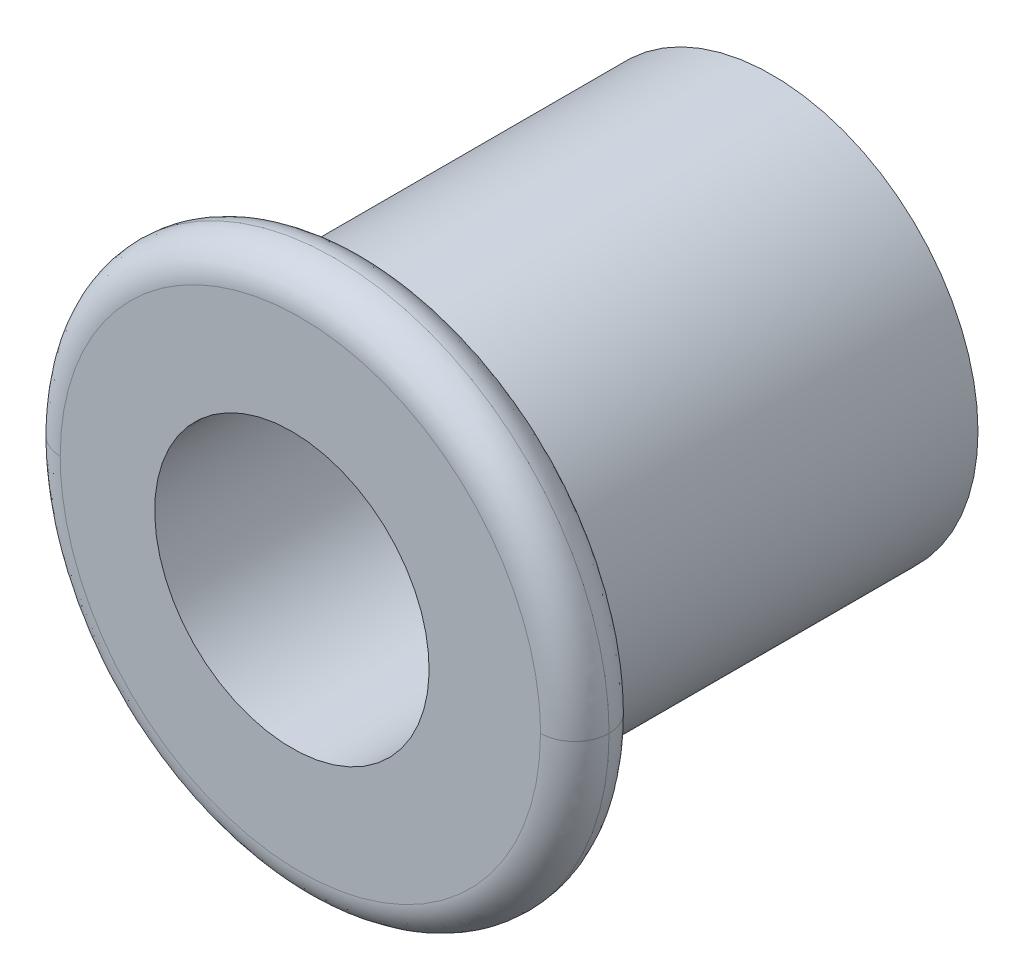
ISO-10303-21;
HEADER;
FILE_DESCRIPTION(('STEP AP214'),'2;1');
FILE_NAME('part.step','',(''),(''),'','','');
FILE_SCHEMA(('AUTOMOTIVE_DESIGN { 1 0 10303 214 1 1 1 1 }'));
ENDSEC;
DATA;
#1=APPLICATION_CONTEXT('core data for automotive mechanical design processes');
#2=APPLICATION_PROTOCOL_DEFINITION('international standard','automotive_design',2000,#1);
#3=PRODUCT_CONTEXT('',#1,'mechanical');
#4=PRODUCT('Part','Part','',(#3));
#5=PRODUCT_RELATED_PRODUCT_CATEGORY('part','',(#4));
#6=PRODUCT_DEFINITION_FORMATION('','',#4);
#7=PRODUCT_DEFINITION_CONTEXT('part definition',#1,'design');
#8=PRODUCT_DEFINITION('design','',#6,#7);
#9=PRODUCT_DEFINITION_SHAPE('','',#8);
#10=(LENGTH_UNIT() NAMED_UNIT(*) SI_UNIT(.MILLI.,.METRE.));
#11=(NAMED_UNIT(*) PLANE_ANGLE_UNIT() SI_UNIT($,.RADIAN.));
#12=(NAMED_UNIT(*) SI_UNIT($,.STERADIAN.) SOLID_ANGLE_UNIT());
#13=UNCERTAINTY_MEASURE_WITH_UNIT(LENGTH_MEASURE(1.E-05),#10,'distance_accuracy_value','');
#14=(GEOMETRIC_REPRESENTATION_CONTEXT(3) GLOBAL_UNCERTAINTY_ASSIGNED_CONTEXT((#13)) GLOBAL_UNIT_ASSIGNED_CONTEXT((#10,
#11,#12)) REPRESENTATION_CONTEXT('',''));
#15=CARTESIAN_POINT('',(0.,0.,0.));
#16=DIRECTION('',(0.,0.,1.));
#17=DIRECTION('',(1.,0.,0.));
#18=AXIS2_PLACEMENT_3D('',#15,#16,#17);
#19=CARTESIAN_POINT('',(0.,0.,1.905));
#20=DIRECTION('',(0.,0.,-1.));
#21=DIRECTION('',(-1.,0.,0.));
#22=AXIS2_PLACEMENT_3D('',#19,#20,#21);
#23=CYLINDRICAL_SURFACE('',#22,0.9525);
#24=CARTESIAN_POINT('',(0.,0.,1.905));
#25=DIRECTION('',(0.,0.,-1.));
#26=DIRECTION('',(-1.,0.,0.));
#27=AXIS2_PLACEMENT_3D('',#24,#25,#26);
#28=CIRCLE('',#27,0.9525);
#29=CARTESIAN_POINT('',(-0.9525,0.,1.905));
#30=VERTEX_POINT('',#29);
#31=EDGE_CURVE('E69',#30,#30,#28,.T.);
#32=ORIENTED_EDGE('',*,*,#31,.T.);
#33=EDGE_LOOP('',(#32));
#34=FACE_BOUND('',#33,.T.);
#35=CARTESIAN_POINT('',(0.,0.,0.));
#36=DIRECTION('',(0.,0.,-1.));
#37=DIRECTION('',(-1.,0.,0.));
#38=AXIS2_PLACEMENT_3D('',#35,#36,#37);
#39=CIRCLE('',#38,0.9525);
#40=CARTESIAN_POINT('',(-0.9525,0.,0.));
#41=VERTEX_POINT('',#40);
#42=EDGE_CURVE('E20',#41,#41,#39,.F.);
#43=ORIENTED_EDGE('',*,*,#42,.T.);
#44=EDGE_LOOP('',(#43));
#45=FACE_BOUND('',#44,.T.);
#46=ADVANCED_FACE('F15',(#34,#45),#23,.T.);
#47=CARTESIAN_POINT('',(-1.2301340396,0.,2.0795985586));
#48=CARTESIAN_POINT('',(-1.2301340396,-2.5384138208,2.0795985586));
#49=CARTESIAN_POINT('',(1.3082798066,-2.5384138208,2.0795985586));
#50=CARTESIAN_POINT('',(1.3082798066,0.,2.0795985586));
#51=CARTESIAN_POINT('',(-1.240963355,0.,1.9716664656));
#52=CARTESIAN_POINT('',(-1.240963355,-2.560072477,1.9716664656));
#53=CARTESIAN_POINT('',(1.319109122,-2.560072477,1.9716664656));
#54=CARTESIAN_POINT('',(1.319109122,0.,1.9716664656));
#55=CARTESIAN_POINT('',(-1.1642606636,0.,1.8949637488));
#56=CARTESIAN_POINT('',(-1.1642606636,-2.4066670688,1.8949637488));
#57=CARTESIAN_POINT('',(1.2424064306,-2.4066670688,1.8949637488));
#58=CARTESIAN_POINT('',(1.2424064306,0.,1.8949637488));
#59=CARTESIAN_POINT('',(-1.0563285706,0.,1.9057930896));
#60=CARTESIAN_POINT('',(-1.0563285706,-2.1908028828,1.9057930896));
#61=CARTESIAN_POINT('',(1.1344743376,-2.1908028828,1.9057930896));
#62=CARTESIAN_POINT('',(1.1344743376,0.,1.9057930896));
#63=(BOUNDED_SURFACE() B_SPLINE_SURFACE(3,3,((#47,#48,#49,#50),(#51,#52,#53,#54),(#55,#56,#57,
#58),(#59,#60,#61,#62)),.UNSPECIFIED.,.F.,.F.,.F.) B_SPLINE_SURFACE_WITH_KNOTS((4,4),(4,4),(0.,
1.),(0.,1.),.UNSPECIFIED.) GEOMETRIC_REPRESENTATION_ITEM() RATIONAL_B_SPLINE_SURFACE(((1.,
0.333333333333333,0.333333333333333,1.),(0.755320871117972,0.251773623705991,0.251773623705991,
0.755320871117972),(0.755320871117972,0.251773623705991,0.251773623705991,0.755320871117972),
(1.,0.333333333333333,0.333333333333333,1.))) REPRESENTATION_ITEM('') SURFACE());
#64=CARTESIAN_POINT('',(1.3082798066,0.,2.0795985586));
#65=CARTESIAN_POINT('',(1.319109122,0.,1.9716664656));
#66=CARTESIAN_POINT('',(1.2424064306,0.,1.8949637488));
#67=CARTESIAN_POINT('',(1.1344743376,0.,1.9057930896));
#68=(BOUNDED_CURVE() B_SPLINE_CURVE(3,(#64,#65,#66,#67),.UNSPECIFIED.,.F.,
.F.) B_SPLINE_CURVE_WITH_KNOTS((4,4),(0.,1.),
.UNSPECIFIED.) CURVE() GEOMETRIC_REPRESENTATION_ITEM() RATIONAL_B_SPLINE_CURVE((1.,
0.755320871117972,0.755320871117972,1.)) REPRESENTATION_ITEM(''));
#69=CARTESIAN_POINT('',(1.15032289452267,0.,1.90499999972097));
#70=VERTEX_POINT('',#69);
#71=CARTESIAN_POINT('',(1.30907289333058,0.,2.06374999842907));
#72=VERTEX_POINT('',#71);
#73=EDGE_CURVE('E62',#70,#72,#68,.F.);
#74=CARTESIAN_POINT('',(0.0390728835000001,0.,2.06374999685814));
#75=DIRECTION('',(0.,0.,1.));
#76=DIRECTION('',(0.,-1.,0.));
#77=AXIS2_PLACEMENT_3D('',#74,#75,#76);
#78=CIRCLE('',#77,1.27000000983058);
#79=CARTESIAN_POINT('',(-1.23092712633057,0.,2.06374999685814));
#80=VERTEX_POINT('',#79);
#81=EDGE_CURVE('E56',#80,#72,#78,.T.);
#82=CARTESIAN_POINT('',(-1.2301340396,0.,2.0795985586));
#83=CARTESIAN_POINT('',(-1.240963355,0.,1.9716664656));
#84=CARTESIAN_POINT('',(-1.1642606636,0.,1.8949637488));
#85=CARTESIAN_POINT('',(-1.0563285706,0.,1.9057930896));
#86=(BOUNDED_CURVE() B_SPLINE_CURVE(3,(#82,#83,#84,#85),.UNSPECIFIED.,.F.,
.F.) B_SPLINE_CURVE_WITH_KNOTS((4,4),(0.,1.),
.UNSPECIFIED.) CURVE() GEOMETRIC_REPRESENTATION_ITEM() RATIONAL_B_SPLINE_CURVE((1.,
0.755320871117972,0.755320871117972,1.)) REPRESENTATION_ITEM(''));
#87=CARTESIAN_POINT('',(-1.07217711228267,0.,1.90499999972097));
#88=VERTEX_POINT('',#87);
#89=EDGE_CURVE('E50',#80,#88,#86,.T.);
#90=CARTESIAN_POINT('',(-1.07217710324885,0.,1.90499999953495));
#91=CARTESIAN_POINT('',(-1.07217717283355,-0.0117582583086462,1.90499999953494));
#92=CARTESIAN_POINT('',(-1.07199048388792,-0.023516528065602,1.90499999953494));
#93=CARTESIAN_POINT('',(-1.07123223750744,-0.0473940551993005,1.90499999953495));
#94=CARTESIAN_POINT('',(-1.07064865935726,-0.0595129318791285,1.90499999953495));
#95=CARTESIAN_POINT('',(-1.06906020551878,-0.0841085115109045,1.90499999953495));
#96=CARTESIAN_POINT('',(-1.06804257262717,-0.0965843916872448,1.90499999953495));
#97=CARTESIAN_POINT('',(-1.06554765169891,-0.121888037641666,1.90499999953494));
#98=CARTESIAN_POINT('',(-1.06405686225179,-0.134714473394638,1.90499999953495));
#99=CARTESIAN_POINT('',(-1.06057530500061,-0.160710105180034,1.90499999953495));
#100=CARTESIAN_POINT('',(-1.05857028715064,-0.173877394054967,1.90499999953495));
#101=CARTESIAN_POINT('',(-1.05401816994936,-0.20054199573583,1.90499999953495));
#102=CARTESIAN_POINT('',(-1.0514560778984,-0.214036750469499,1.90499999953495));
#103=CARTESIAN_POINT('',(-1.04574613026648,-0.241339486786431,1.90499999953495));
#104=CARTESIAN_POINT('',(-1.04258255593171,-0.25514418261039,1.90499999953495));
#105=CARTESIAN_POINT('',(-1.03562466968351,-0.283045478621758,1.90499999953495));
#106=CARTESIAN_POINT('',(-1.03181394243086,-0.297137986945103,1.90499999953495));
#107=CARTESIAN_POINT('',(-1.02351584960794,-0.325588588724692,1.90499999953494));
#108=CARTESIAN_POINT('',(-1.01901141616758,-0.3399417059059,1.90499999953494));
#109=CARTESIAN_POINT('',(-1.00927954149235,-0.368881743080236,1.90499999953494));
#110=CARTESIAN_POINT('',(-1.00403444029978,-0.383462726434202,1.90499999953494));
#111=CARTESIAN_POINT('',(-0.992774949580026,-0.412820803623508,1.90499999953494));
#112=CARTESIAN_POINT('',(-0.986742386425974,-0.427590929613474,1.90499999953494));
#113=CARTESIAN_POINT('',(-0.973862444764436,-0.457283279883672,1.90499999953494));
#114=CARTESIAN_POINT('',(-0.966996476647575,-0.472197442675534,1.90499999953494));
#115=CARTESIAN_POINT('',(-0.952405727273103,-0.502127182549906,1.90499999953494));
#116=CARTESIAN_POINT('',(-0.944662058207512,-0.517133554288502,1.90499999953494));
#117=CARTESIAN_POINT('',(-0.92827432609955,-0.547190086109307,1.90499999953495));
#118=CARTESIAN_POINT('',(-0.919611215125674,-0.562229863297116,1.90499999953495));
#119=CARTESIAN_POINT('',(-0.901346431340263,-0.592288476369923,1.90499999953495));
#120=CARTESIAN_POINT('',(-0.891725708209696,-0.607295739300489,1.90499999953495));
#121=CARTESIAN_POINT('',(-0.871512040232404,-0.637217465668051,1.90499999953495));
#122=CARTESIAN_POINT('',(-0.860900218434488,-0.652119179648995,1.90499999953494));
#123=CARTESIAN_POINT('',(-0.838676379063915,-0.681750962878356,1.90499999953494));
#124=CARTESIAN_POINT('',(-0.827045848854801,-0.696467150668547,1.90499999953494));
#125=CARTESIAN_POINT('',(-0.802763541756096,-0.725642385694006,1.90499999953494));
#126=CARTESIAN_POINT('',(-0.790093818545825,-0.740086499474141,1.90499999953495));
#127=CARTESIAN_POINT('',(-0.763720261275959,-0.768625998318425,1.90499999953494));
#128=CARTESIAN_POINT('',(-0.749999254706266,-0.782705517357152,1.90499999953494));
#129=CARTESIAN_POINT('',(-0.721519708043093,-0.810418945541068,1.90499999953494));
#130=CARTESIAN_POINT('',(-0.706744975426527,-0.824036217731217,1.90499999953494));
#131=CARTESIAN_POINT('',(-0.676165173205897,-0.8507240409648,1.90499999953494));
#132=CARTESIAN_POINT('',(-0.660345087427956,-0.863777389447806,1.90499999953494));
#133=CARTESIAN_POINT('',(-0.627693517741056,-0.889233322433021,1.90499999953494));
#134=CARTESIAN_POINT('',(-0.610848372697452,-0.901618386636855,1.90499999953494));
#135=CARTESIAN_POINT('',(-0.576178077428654,-0.925632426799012,1.90499999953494));
#136=CARTESIAN_POINT('',(-0.558340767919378,-0.937243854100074,1.90499999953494));
#137=CARTESIAN_POINT('',(-0.521731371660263,-0.959605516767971,1.90499999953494));
#138=CARTESIAN_POINT('',(-0.502948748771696,-0.970338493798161,1.90499999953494));
#139=CARTESIAN_POINT('',(-0.464505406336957,-0.990841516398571,1.90499999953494));
#140=CARTESIAN_POINT('',(-0.44483580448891,-1.00059495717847,1.90499999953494));
#141=CARTESIAN_POINT('',(-0.414826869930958,-1.01438377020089,1.90499999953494));
#142=CARTESIAN_POINT('',(-0.404687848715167,-1.01886004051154,1.90499999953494));
#143=CARTESIAN_POINT('',(-0.384217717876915,-1.02753388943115,1.90499999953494));
#144=CARTESIAN_POINT('',(-0.373885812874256,-1.03172959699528,1.90499999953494));
#145=CARTESIAN_POINT('',(-0.353041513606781,-1.03983103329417,1.90499999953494));
#146=CARTESIAN_POINT('',(-0.3425284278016,-1.04373498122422,1.90499999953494));
#147=CARTESIAN_POINT('',(-0.321333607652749,-1.0512424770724,1.90499999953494));
#148=CARTESIAN_POINT('',(-0.3106512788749,-1.05484434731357,1.90499999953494));
#149=CARTESIAN_POINT('',(-0.289130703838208,-1.06173782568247,1.90499999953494));
#150=CARTESIAN_POINT('',(-0.278291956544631,-1.06502786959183,1.90499999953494));
#151=CARTESIAN_POINT('',(-0.256471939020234,-1.0712885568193,1.90499999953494));
#152=CARTESIAN_POINT('',(-0.2454902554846,-1.07425775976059,1.90499999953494));
#153=CARTESIAN_POINT('',(-0.223398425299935,-1.07986838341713,1.90499999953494));
#154=CARTESIAN_POINT('',(-0.212287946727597,-1.08250849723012,1.90499999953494));
#155=CARTESIAN_POINT('',(-0.189953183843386,-1.08745338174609,1.90499999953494));
#156=CARTESIAN_POINT('',(-0.178728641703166,-1.08975698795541,1.90499999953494));
#157=CARTESIAN_POINT('',(-0.156180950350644,-1.09402216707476,1.90499999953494));
#158=CARTESIAN_POINT('',(-0.144857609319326,-1.09598272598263,1.90499999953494));
#159=CARTESIAN_POINT('',(-0.122127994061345,-1.09955603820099,1.90499999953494));
#160=CARTESIAN_POINT('',(-0.110721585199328,-1.10116793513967,1.90499999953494));
#161=CARTESIAN_POINT('',(-0.0878419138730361,-1.10403910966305,1.90499999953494));
#162=CARTESIAN_POINT('',(-0.0763685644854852,-1.1052976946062,1.90499999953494));
#163=CARTESIAN_POINT('',(-0.0533714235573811,-1.10745842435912,1.90499999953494));
#164=CARTESIAN_POINT('',(-0.041847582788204,-1.10836004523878,1.90499999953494));
#165=CARTESIAN_POINT('',(-0.018766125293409,-1.10980404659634,1.90499999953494));
#166=CARTESIAN_POINT('',(-0.00720848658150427,-1.11034607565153,1.90499999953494));
#167=CARTESIAN_POINT('',(0.0159237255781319,-1.11106913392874,1.90499999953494));
#168=CARTESIAN_POINT('',(0.0274983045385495,-1.11124998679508,1.90499999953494));
#169=CARTESIAN_POINT('',(0.0506474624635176,-1.11124998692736,1.90499999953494));
#170=CARTESIAN_POINT('',(0.062222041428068,-1.11106913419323,1.90499999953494));
#171=CARTESIAN_POINT('',(0.0853542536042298,-1.1103460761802,1.90499999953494));
#172=CARTESIAN_POINT('',(0.0969118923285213,-1.10980404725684,1.90499999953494));
#173=CARTESIAN_POINT('',(0.119993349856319,-1.1083600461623,1.90499999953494));
#174=CARTESIAN_POINT('',(0.131517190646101,-1.10745842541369,1.90499999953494));
#175=CARTESIAN_POINT('',(0.154514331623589,-1.10529769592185,1.90499999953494));
#176=CARTESIAN_POINT('',(0.165987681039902,-1.10403911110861,1.90499999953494));
#177=CARTESIAN_POINT('',(0.188867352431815,-1.10116793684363,1.90499999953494));
#178=CARTESIAN_POINT('',(0.200273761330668,-1.09955604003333,1.90499999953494));
#179=CARTESIAN_POINT('',(0.223003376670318,-1.09598272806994,1.90499999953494));
#180=CARTESIAN_POINT('',(0.23432671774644,-1.09402216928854,1.90499999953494));
#181=CARTESIAN_POINT('',(0.256874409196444,-1.08975699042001,1.90499999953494));
#182=CARTESIAN_POINT('',(0.268098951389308,-1.08745338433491,1.90499999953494));
#183=CARTESIAN_POINT('',(0.290433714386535,-1.08250850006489,1.90499999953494));
#184=CARTESIAN_POINT('',(0.301544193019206,-1.07986838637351,1.90499999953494));
#185=CARTESIAN_POINT('',(0.323636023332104,-1.07425776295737,1.90499999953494));
#186=CARTESIAN_POINT('',(0.334617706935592,-1.07128856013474,1.90499999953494));
#187=CARTESIAN_POINT('',(0.35643772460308,-1.06502787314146,1.90499999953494));
#188=CARTESIAN_POINT('',(0.367276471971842,-1.0617378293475,1.90499999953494));
#189=CARTESIAN_POINT('',(0.388797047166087,-1.05484435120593,1.90499999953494));
#190=CARTESIAN_POINT('',(0.399479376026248,-1.05124248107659,1.90499999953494));
#191=CARTESIAN_POINT('',(0.420674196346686,-1.0437349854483,1.90499999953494));
#192=CARTESIAN_POINT('',(0.431187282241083,-1.03983103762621,1.90499999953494));
#193=CARTESIAN_POINT('',(0.452031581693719,-1.03172960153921,1.90499999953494));
#194=CARTESIAN_POINT('',(0.46236348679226,-1.02753389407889,1.90499999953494));
#195=CARTESIAN_POINT('',(0.482833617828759,-1.01886004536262,1.90499999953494));
#196=CARTESIAN_POINT('',(0.492972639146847,-1.01438377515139,1.90499999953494));
#197=CARTESIAN_POINT('',(0.522981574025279,-1.00059496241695,1.90499999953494));
#198=CARTESIAN_POINT('',(0.542651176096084,-0.990841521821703,1.90499999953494));
#199=CARTESIAN_POINT('',(0.581094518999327,-0.970338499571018,1.90499999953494));
#200=CARTESIAN_POINT('',(0.59987714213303,-0.959605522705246,1.90499999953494));
#201=CARTESIAN_POINT('',(0.636486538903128,-0.937243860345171,1.90499999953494));
#202=CARTESIAN_POINT('',(0.654323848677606,-0.925632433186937,1.90499999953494));
#203=CARTESIAN_POINT('',(0.688994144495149,-0.901618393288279,1.90499999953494));
#204=CARTESIAN_POINT('',(0.705839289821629,-0.88923332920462,1.90499999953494));
#205=CARTESIAN_POINT('',(0.738490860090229,-0.863777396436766,1.90499999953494));
#206=CARTESIAN_POINT('',(0.754310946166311,-0.850724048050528,1.90499999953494));
#207=CARTESIAN_POINT('',(0.784890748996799,-0.824036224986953,1.90499999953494));
#208=CARTESIAN_POINT('',(0.799665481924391,-0.810418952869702,1.90499999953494));
#209=CARTESIAN_POINT('',(0.828145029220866,-0.782705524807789,1.90499999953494));
#210=CARTESIAN_POINT('',(0.841866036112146,-0.7686260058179,1.90499999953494));
#211=CARTESIAN_POINT('',(0.868239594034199,-0.740086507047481,1.90499999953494));
#212=CARTESIAN_POINT('',(0.88090931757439,-0.725642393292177,1.90499999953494));
#213=CARTESIAN_POINT('',(0.905191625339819,-0.696467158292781,1.90499999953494));
#214=CARTESIAN_POINT('',(0.91682215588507,-0.681750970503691,1.90499999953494));
#215=CARTESIAN_POINT('',(0.939045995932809,-0.652119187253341,1.90499999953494));
#216=CARTESIAN_POINT('',(0.949657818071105,-0.637217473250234,1.90499999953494));
#217=CARTESIAN_POINT('',(0.969871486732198,-0.607295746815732,1.90499999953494));
#218=CARTESIAN_POINT('',(0.979492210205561,-0.59228848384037,1.90499999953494));
#219=CARTESIAN_POINT('',(0.99775699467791,-0.562229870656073,1.90499999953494));
#220=CARTESIAN_POINT('',(1.00642010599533,-0.547190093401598,1.90499999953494));
#221=CARTESIAN_POINT('',(1.02280783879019,-0.517133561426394,1.90499999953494));
#222=CARTESIAN_POINT('',(1.03055150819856,-0.502127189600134,1.90499999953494));
#223=CARTESIAN_POINT('',(1.04514225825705,-0.472197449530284,1.90499999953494));
#224=CARTESIAN_POINT('',(1.05200822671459,-0.457283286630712,1.90499999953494));
#225=CARTESIAN_POINT('',(1.06488816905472,-0.427590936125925,1.90499999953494));
#226=CARTESIAN_POINT('',(1.07092073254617,-0.412820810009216,1.90499999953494));
#227=CARTESIAN_POINT('',(1.08218022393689,-0.383462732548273,1.90499999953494));
#228=CARTESIAN_POINT('',(1.08742532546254,-0.368881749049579,1.90499999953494));
#229=CARTESIAN_POINT('',(1.09715720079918,-0.339941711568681,1.90499999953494));
#230=CARTESIAN_POINT('',(1.10166163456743,-0.325588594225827,1.90499999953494));
#231=CARTESIAN_POINT('',(1.10995972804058,-0.297137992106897,1.90499999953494));
#232=CARTESIAN_POINT('',(1.11377045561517,-0.283045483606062,1.90499999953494));
#233=CARTESIAN_POINT('',(1.12072834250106,-0.25514418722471,1.90499999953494));
#234=CARTESIAN_POINT('',(1.12389191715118,-0.241339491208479,1.90499999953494));
#235=CARTESIAN_POINT('',(1.12960186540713,-0.214036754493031,1.90499999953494));
#236=CARTESIAN_POINT('',(1.13216395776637,-0.20054199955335,1.90499999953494));
#237=CARTESIAN_POINT('',(1.13671607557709,-0.173877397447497,1.90499999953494));
#238=CARTESIAN_POINT('',(1.13872109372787,-0.160710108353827,1.90499999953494));
#239=CARTESIAN_POINT('',(1.14220265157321,-0.134714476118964,1.90499999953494));
#240=CARTESIAN_POINT('',(1.14369344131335,-0.121888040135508,1.90499999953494));
#241=CARTESIAN_POINT('',(1.14618836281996,-0.096584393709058,1.90499999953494));
#242=CARTESIAN_POINT('',(1.14720599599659,-0.0841085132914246,1.90499999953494));
#243=CARTESIAN_POINT('',(1.14879445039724,-0.0595129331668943,1.90499999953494));
#244=CARTESIAN_POINT('',(1.14937802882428,-0.0473940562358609,1.90499999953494));
#245=CARTESIAN_POINT('',(1.15013627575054,-0.023516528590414,1.90499999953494));
#246=CARTESIAN_POINT('',(1.1503229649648,-0.0117582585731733,1.90499999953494));
#247=CARTESIAN_POINT('',(1.15032289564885,0.,1.90499999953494));
#248=B_SPLINE_CURVE_WITH_KNOTS('',3,(#90,#91,#92,#93,#94,#95,#96,#97,#98,#99,#100,#101,#102,
#103,#104,#105,#106,#107,#108,#109,#110,#111,#112,#113,#114,#115,#116,#117,#118,#119,#120,#121,
#122,#123,#124,#125,#126,#127,#128,#129,#130,#131,#132,#133,#134,#135,#136,#137,#138,#139,#140,
#141,#142,#143,#144,#145,#146,#147,#148,#149,#150,#151,#152,#153,#154,#155,#156,#157,#158,#159,
#160,#161,#162,#163,#164,#165,#166,#167,#168,#169,#170,#171,#172,#173,#174,#175,#176,#177,#178,
#179,#180,#181,#182,#183,#184,#185,#186,#187,#188,#189,#190,#191,#192,#193,#194,#195,#196,#197,
#198,#199,#200,#201,#202,#203,#204,#205,#206,#207,#208,#209,#210,#211,#212,#213,#214,#215,#216,
#217,#218,#219,#220,#221,#222,#223,#224,#225,#226,#227,#228,#229,#230,#231,#232,#233,#234,#235,
#236,#237,#238,#239,#240,#241,#242,#243,#244,#245,#246,#247),.UNSPECIFIED.,.F.,.F.,(4,2,2,2,2,2,
2,2,2,2,2,2,2,2,2,2,2,2,2,2,2,2,2,2,2,2,2,2,2,2,2,2,2,2,2,2,2,2,2,2,2,2,2,2,2,2,2,2,2,2,2,2,2,2,
2,2,2,2,2,2,2,2,2,2,2,2,2,2,2,2,2,2,2,2,2,2,2,2,4),(0.,0.0352733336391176,0.0716655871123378,
0.109210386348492,0.147940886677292,0.187889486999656,0.229087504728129,0.271564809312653,
0.315349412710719,0.36046701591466,0.406940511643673,0.454789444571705,0.50402943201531,
0.554671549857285,0.606721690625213,0.660179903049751,0.715039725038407,0.771287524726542,
0.828901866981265,0.887852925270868,0.948101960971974,1.00960089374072,1.07229198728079,
1.13610767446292,1.20097054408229,1.2667935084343,1.30003897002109,1.33348767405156,
1.36712620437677,1.40094064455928,1.43491660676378,1.46903926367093,1.5032933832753,
1.53766336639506,1.57213328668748,1.60668693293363,1.64130785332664,1.67597940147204,
1.71068478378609,1.74540710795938,1.78012943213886,1.8148348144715,1.84950636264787,
1.88412728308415,1.91868092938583,1.95315084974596,1.98752083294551,2.02177495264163,
2.05589760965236,2.08987357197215,2.12368801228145,2.15732654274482,2.19077524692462,
2.22402070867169,2.28984367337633,2.35470654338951,2.41852223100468,2.48121332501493,
2.54271225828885,2.60296129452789,2.66191235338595,2.71952669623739,2.77577449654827,
2.83063431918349,2.88409253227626,2.93614267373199,2.98678479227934,3.03602478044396,
3.08387371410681,3.13034721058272,3.17546481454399,3.21924941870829,3.2617267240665,
3.3029247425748,3.34287334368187,3.38160384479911,3.41914864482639,3.45554089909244,
3.4908142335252),.UNSPECIFIED.);
#249=EDGE_CURVE('E53',#88,#70,#248,.T.);
#250=ORIENTED_EDGE('',*,*,#73,.T.);
#251=ORIENTED_EDGE('',*,*,#81,.F.);
#252=ORIENTED_EDGE('',*,*,#89,.T.);
#253=ORIENTED_EDGE('',*,*,#249,.T.);
#254=EDGE_LOOP('',(#250,#251,#252,#253));
#255=FACE_BOUND('',#254,.T.);
#256=ADVANCED_FACE('F52',(#255),#63,.T.);
#257=CARTESIAN_POINT('',(-0.96393,-0.96393,0.));
#258=DIRECTION('',(0.,0.,1.));
#259=DIRECTION('',(1.,0.,0.));
#260=AXIS2_PLACEMENT_3D('',#257,#258,#259);
#261=PLANE('',#260);
#262=CARTESIAN_POINT('',(0.,0.,0.));
#263=DIRECTION('',(0.,0.,-1.));
#264=DIRECTION('',(0.,1.,0.));
#265=AXIS2_PLACEMENT_3D('',#262,#263,#264);
#266=CIRCLE('',#265,0.635);
#267=CARTESIAN_POINT('',(0.,0.634999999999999,0.));
#268=VERTEX_POINT('',#267);
#269=EDGE_CURVE('E75',#268,#268,#266,.T.);
#270=ORIENTED_EDGE('',*,*,#269,.F.);
#271=EDGE_LOOP('',(#270));
#272=FACE_BOUND('',#271,.T.);
#273=ORIENTED_EDGE('',*,*,#42,.F.);
#274=EDGE_LOOP('',(#273));
#275=FACE_BOUND('',#274,.T.);
#276=ADVANCED_FACE('F126',(#272,#275),#261,.F.);
#277=CARTESIAN_POINT('',(-1.0855121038,-1.124585,1.905));
#278=DIRECTION('',(0.,0.,1.));
#279=DIRECTION('',(1.,0.,0.));
#280=AXIS2_PLACEMENT_3D('',#277,#278,#279);
#281=PLANE('',#280);
#282=ORIENTED_EDGE('',*,*,#31,.F.);
#283=EDGE_LOOP('',(#282));
#284=FACE_BOUND('',#283,.T.);
#285=CARTESIAN_POINT('',(1.15032289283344,0.,1.90499999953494));
#286=CARTESIAN_POINT('',(1.15032289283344,2.22249999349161,1.90499999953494));
#287=CARTESIAN_POINT('',(-1.07217712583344,2.22249999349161,1.90499999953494));
#288=CARTESIAN_POINT('',(-1.07217712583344,0.,1.90499999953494));
#289=(BOUNDED_CURVE() B_SPLINE_CURVE(3,(#285,#286,#287,#288),.UNSPECIFIED.,.F.,
.F.) B_SPLINE_CURVE_WITH_KNOTS((4,4),(0.,1.),
.UNSPECIFIED.) CURVE() GEOMETRIC_REPRESENTATION_ITEM() RATIONAL_B_SPLINE_CURVE((0.956578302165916,
0.318859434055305,0.318859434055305,0.956578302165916)) REPRESENTATION_ITEM(''));
#290=EDGE_CURVE('E67',#70,#88,#289,.T.);
#291=ORIENTED_EDGE('',*,*,#290,.F.);
#292=ORIENTED_EDGE('',*,*,#249,.F.);
#293=EDGE_LOOP('',(#291,#292));
#294=FACE_BOUND('',#293,.T.);
#295=ADVANCED_FACE('F66',(#284,#294),#281,.F.);
#296=CARTESIAN_POINT('',(-1.0563285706,0.,2.2217069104));
#297=CARTESIAN_POINT('',(-1.0563285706,-2.1908028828,2.2217069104));
#298=CARTESIAN_POINT('',(1.1344743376,-2.1908028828,2.2217069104));
#299=CARTESIAN_POINT('',(1.1344743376,0.,2.2217069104));
#300=CARTESIAN_POINT('',(-1.1642606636,0.,2.2325362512));
#301=CARTESIAN_POINT('',(-1.1642606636,-2.4066670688,2.2325362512));
#302=CARTESIAN_POINT('',(1.2424064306,-2.4066670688,2.2325362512));
#303=CARTESIAN_POINT('',(1.2424064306,0.,2.2325362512));
#304=CARTESIAN_POINT('',(-1.240963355,0.,2.1558335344));
#305=CARTESIAN_POINT('',(-1.240963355,-2.560072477,2.1558335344));
#306=CARTESIAN_POINT('',(1.319109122,-2.560072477,2.1558335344));
#307=CARTESIAN_POINT('',(1.319109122,0.,2.1558335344));
#308=CARTESIAN_POINT('',(-1.2301340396,0.,2.0479014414));
#309=CARTESIAN_POINT('',(-1.2301340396,-2.5384138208,2.0479014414));
#310=CARTESIAN_POINT('',(1.3082798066,-2.5384138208,2.0479014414));
#311=CARTESIAN_POINT('',(1.3082798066,0.,2.0479014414));
#312=(BOUNDED_SURFACE() B_SPLINE_SURFACE(3,3,((#296,#297,#298,#299),(#300,#301,#302,#303),(#304,
#305,#306,#307),(#308,#309,#310,#311)),.UNSPECIFIED.,.F.,.F.,
.F.) B_SPLINE_SURFACE_WITH_KNOTS((4,4),(4,4),(0.,1.),(0.,1.),
.UNSPECIFIED.) GEOMETRIC_REPRESENTATION_ITEM() RATIONAL_B_SPLINE_SURFACE(((1.,0.333333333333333,
0.333333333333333,1.),(0.755320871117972,0.251773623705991,0.251773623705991,0.755320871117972),
(0.755320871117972,0.251773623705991,0.251773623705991,0.755320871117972),(1.,0.333333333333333,
0.333333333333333,1.))) REPRESENTATION_ITEM('') SURFACE());
#313=CARTESIAN_POINT('',(1.1344743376,0.,2.2217069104));
#314=CARTESIAN_POINT('',(1.2424064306,0.,2.2325362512));
#315=CARTESIAN_POINT('',(1.319109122,0.,2.1558335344));
#316=CARTESIAN_POINT('',(1.3082798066,0.,2.0479014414));
#317=(BOUNDED_CURVE() B_SPLINE_CURVE(3,(#313,#314,#315,#316),.UNSPECIFIED.,.F.,
.F.) B_SPLINE_CURVE_WITH_KNOTS((4,4),(0.,1.),
.UNSPECIFIED.) CURVE() GEOMETRIC_REPRESENTATION_ITEM() RATIONAL_B_SPLINE_CURVE((1.,
0.755320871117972,0.755320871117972,1.)) REPRESENTATION_ITEM(''));
#318=CARTESIAN_POINT('',(1.15032289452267,0.,2.22250000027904));
#319=VERTEX_POINT('',#318);
#320=EDGE_CURVE('E34',#72,#319,#317,.F.);
#321=CARTESIAN_POINT('',(1.15032289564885,0.,2.22250000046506));
#322=CARTESIAN_POINT('',(1.1503229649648,-0.0117582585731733,2.22250000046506));
#323=CARTESIAN_POINT('',(1.15013627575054,-0.023516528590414,2.22250000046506));
#324=CARTESIAN_POINT('',(1.14937802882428,-0.0473940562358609,2.22250000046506));
#325=CARTESIAN_POINT('',(1.14879445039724,-0.0595129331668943,2.22250000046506));
#326=CARTESIAN_POINT('',(1.14720599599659,-0.0841085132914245,2.22250000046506));
#327=CARTESIAN_POINT('',(1.14618836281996,-0.096584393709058,2.22250000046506));
#328=CARTESIAN_POINT('',(1.14369344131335,-0.121888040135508,2.22250000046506));
#329=CARTESIAN_POINT('',(1.14220265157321,-0.134714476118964,2.22250000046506));
#330=CARTESIAN_POINT('',(1.13872109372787,-0.160710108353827,2.22250000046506));
#331=CARTESIAN_POINT('',(1.13671607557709,-0.173877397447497,2.22250000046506));
#332=CARTESIAN_POINT('',(1.13216395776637,-0.20054199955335,2.22250000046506));
#333=CARTESIAN_POINT('',(1.12960186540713,-0.214036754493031,2.22250000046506));
#334=CARTESIAN_POINT('',(1.12389191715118,-0.241339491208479,2.22250000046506));
#335=CARTESIAN_POINT('',(1.12072834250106,-0.25514418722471,2.22250000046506));
#336=CARTESIAN_POINT('',(1.11377045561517,-0.283045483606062,2.22250000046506));
#337=CARTESIAN_POINT('',(1.10995972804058,-0.297137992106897,2.22250000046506));
#338=CARTESIAN_POINT('',(1.10166163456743,-0.325588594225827,2.22250000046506));
#339=CARTESIAN_POINT('',(1.09715720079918,-0.339941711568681,2.22250000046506));
#340=CARTESIAN_POINT('',(1.08742532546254,-0.368881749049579,2.22250000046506));
#341=CARTESIAN_POINT('',(1.08218022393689,-0.383462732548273,2.22250000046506));
#342=CARTESIAN_POINT('',(1.07092073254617,-0.412820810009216,2.22250000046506));
#343=CARTESIAN_POINT('',(1.06488816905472,-0.427590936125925,2.22250000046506));
#344=CARTESIAN_POINT('',(1.05200822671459,-0.457283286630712,2.22250000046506));
#345=CARTESIAN_POINT('',(1.04514225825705,-0.472197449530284,2.22250000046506));
#346=CARTESIAN_POINT('',(1.03055150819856,-0.502127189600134,2.22250000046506));
#347=CARTESIAN_POINT('',(1.02280783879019,-0.517133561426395,2.22250000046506));
#348=CARTESIAN_POINT('',(1.00642010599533,-0.547190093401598,2.22250000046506));
#349=CARTESIAN_POINT('',(0.997756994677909,-0.562229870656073,2.22250000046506));
#350=CARTESIAN_POINT('',(0.97949221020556,-0.59228848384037,2.22250000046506));
#351=CARTESIAN_POINT('',(0.969871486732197,-0.607295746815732,2.22250000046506));
#352=CARTESIAN_POINT('',(0.949657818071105,-0.637217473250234,2.22250000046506));
#353=CARTESIAN_POINT('',(0.939045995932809,-0.652119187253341,2.22250000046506));
#354=CARTESIAN_POINT('',(0.916822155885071,-0.681750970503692,2.22250000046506));
#355=CARTESIAN_POINT('',(0.905191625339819,-0.696467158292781,2.22250000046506));
#356=CARTESIAN_POINT('',(0.88090931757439,-0.725642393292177,2.22250000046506));
#357=CARTESIAN_POINT('',(0.868239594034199,-0.740086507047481,2.22250000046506));
#358=CARTESIAN_POINT('',(0.841866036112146,-0.7686260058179,2.22250000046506));
#359=CARTESIAN_POINT('',(0.828145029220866,-0.782705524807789,2.22250000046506));
#360=CARTESIAN_POINT('',(0.79966548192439,-0.810418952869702,2.22250000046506));
#361=CARTESIAN_POINT('',(0.784890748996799,-0.824036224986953,2.22250000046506));
#362=CARTESIAN_POINT('',(0.754310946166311,-0.850724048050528,2.22250000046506));
#363=CARTESIAN_POINT('',(0.738490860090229,-0.863777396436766,2.22250000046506));
#364=CARTESIAN_POINT('',(0.705839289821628,-0.88923332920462,2.22250000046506));
#365=CARTESIAN_POINT('',(0.688994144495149,-0.901618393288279,2.22250000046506));
#366=CARTESIAN_POINT('',(0.654323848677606,-0.925632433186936,2.22250000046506));
#367=CARTESIAN_POINT('',(0.636486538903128,-0.93724386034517,2.22250000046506));
#368=CARTESIAN_POINT('',(0.59987714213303,-0.959605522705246,2.22250000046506));
#369=CARTESIAN_POINT('',(0.581094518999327,-0.970338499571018,2.22250000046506));
#370=CARTESIAN_POINT('',(0.542651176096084,-0.990841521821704,2.22250000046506));
#371=CARTESIAN_POINT('',(0.522981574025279,-1.00059496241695,2.22250000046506));
#372=CARTESIAN_POINT('',(0.492972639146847,-1.01438377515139,2.22250000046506));
#373=CARTESIAN_POINT('',(0.482833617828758,-1.01886004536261,2.22250000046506));
#374=CARTESIAN_POINT('',(0.46236348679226,-1.02753389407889,2.22250000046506));
#375=CARTESIAN_POINT('',(0.452031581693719,-1.03172960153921,2.22250000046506));
#376=CARTESIAN_POINT('',(0.431187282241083,-1.03983103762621,2.22250000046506));
#377=CARTESIAN_POINT('',(0.420674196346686,-1.0437349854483,2.22250000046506));
#378=CARTESIAN_POINT('',(0.399479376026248,-1.05124248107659,2.22250000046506));
#379=CARTESIAN_POINT('',(0.388797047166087,-1.05484435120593,2.22250000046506));
#380=CARTESIAN_POINT('',(0.367276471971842,-1.0617378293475,2.22250000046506));
#381=CARTESIAN_POINT('',(0.35643772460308,-1.06502787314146,2.22250000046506));
#382=CARTESIAN_POINT('',(0.334617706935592,-1.07128856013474,2.22250000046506));
#383=CARTESIAN_POINT('',(0.323636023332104,-1.07425776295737,2.22250000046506));
#384=CARTESIAN_POINT('',(0.301544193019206,-1.07986838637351,2.22250000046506));
#385=CARTESIAN_POINT('',(0.290433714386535,-1.08250850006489,2.22250000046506));
#386=CARTESIAN_POINT('',(0.268098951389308,-1.08745338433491,2.22250000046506));
#387=CARTESIAN_POINT('',(0.256874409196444,-1.08975699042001,2.22250000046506));
#388=CARTESIAN_POINT('',(0.23432671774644,-1.09402216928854,2.22250000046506));
#389=CARTESIAN_POINT('',(0.223003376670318,-1.09598272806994,2.22250000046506));
#390=CARTESIAN_POINT('',(0.200273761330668,-1.09955604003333,2.22250000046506));
#391=CARTESIAN_POINT('',(0.188867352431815,-1.10116793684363,2.22250000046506));
#392=CARTESIAN_POINT('',(0.165987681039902,-1.10403911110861,2.22250000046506));
#393=CARTESIAN_POINT('',(0.154514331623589,-1.10529769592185,2.22250000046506));
#394=CARTESIAN_POINT('',(0.131517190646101,-1.10745842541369,2.22250000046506));
#395=CARTESIAN_POINT('',(0.119993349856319,-1.1083600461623,2.22250000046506));
#396=CARTESIAN_POINT('',(0.0969118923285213,-1.10980404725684,2.22250000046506));
#397=CARTESIAN_POINT('',(0.0853542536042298,-1.1103460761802,2.22250000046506));
#398=CARTESIAN_POINT('',(0.0622220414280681,-1.11106913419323,2.22250000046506));
#399=CARTESIAN_POINT('',(0.0506474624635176,-1.11124998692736,2.22250000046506));
#400=CARTESIAN_POINT('',(0.0274983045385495,-1.11124998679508,2.22250000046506));
#401=CARTESIAN_POINT('',(0.0159237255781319,-1.11106913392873,2.22250000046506));
#402=CARTESIAN_POINT('',(-0.00720848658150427,-1.11034607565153,2.22250000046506));
#403=CARTESIAN_POINT('',(-0.018766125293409,-1.10980404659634,2.22250000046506));
#404=CARTESIAN_POINT('',(-0.041847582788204,-1.10836004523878,2.22250000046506));
#405=CARTESIAN_POINT('',(-0.0533714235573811,-1.10745842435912,2.22250000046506));
#406=CARTESIAN_POINT('',(-0.0763685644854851,-1.10529769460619,2.22250000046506));
#407=CARTESIAN_POINT('',(-0.0878419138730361,-1.10403910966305,2.22250000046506));
#408=CARTESIAN_POINT('',(-0.110721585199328,-1.10116793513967,2.22250000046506));
#409=CARTESIAN_POINT('',(-0.122127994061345,-1.09955603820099,2.22250000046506));
#410=CARTESIAN_POINT('',(-0.144857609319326,-1.09598272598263,2.22250000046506));
#411=CARTESIAN_POINT('',(-0.156180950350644,-1.09402216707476,2.22250000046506));
#412=CARTESIAN_POINT('',(-0.178728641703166,-1.08975698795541,2.22250000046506));
#413=CARTESIAN_POINT('',(-0.189953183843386,-1.08745338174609,2.22250000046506));
#414=CARTESIAN_POINT('',(-0.212287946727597,-1.08250849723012,2.22250000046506));
#415=CARTESIAN_POINT('',(-0.223398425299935,-1.07986838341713,2.22250000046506));
#416=CARTESIAN_POINT('',(-0.2454902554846,-1.07425775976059,2.22250000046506));
#417=CARTESIAN_POINT('',(-0.256471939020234,-1.0712885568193,2.22250000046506));
#418=CARTESIAN_POINT('',(-0.278291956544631,-1.06502786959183,2.22250000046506));
#419=CARTESIAN_POINT('',(-0.289130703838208,-1.06173782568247,2.22250000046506));
#420=CARTESIAN_POINT('',(-0.3106512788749,-1.05484434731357,2.22250000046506));
#421=CARTESIAN_POINT('',(-0.321333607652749,-1.0512424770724,2.22250000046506));
#422=CARTESIAN_POINT('',(-0.3425284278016,-1.04373498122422,2.22250000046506));
#423=CARTESIAN_POINT('',(-0.353041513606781,-1.03983103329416,2.22250000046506));
#424=CARTESIAN_POINT('',(-0.373885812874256,-1.03172959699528,2.22250000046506));
#425=CARTESIAN_POINT('',(-0.384217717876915,-1.02753388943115,2.22250000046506));
#426=CARTESIAN_POINT('',(-0.404687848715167,-1.01886004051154,2.22250000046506));
#427=CARTESIAN_POINT('',(-0.414826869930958,-1.01438377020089,2.22250000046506));
#428=CARTESIAN_POINT('',(-0.44483580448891,-1.00059495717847,2.22250000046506));
#429=CARTESIAN_POINT('',(-0.464505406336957,-0.990841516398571,2.22250000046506));
#430=CARTESIAN_POINT('',(-0.502948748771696,-0.97033849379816,2.22250000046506));
#431=CARTESIAN_POINT('',(-0.521731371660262,-0.959605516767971,2.22250000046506));
#432=CARTESIAN_POINT('',(-0.558340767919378,-0.937243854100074,2.22250000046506));
#433=CARTESIAN_POINT('',(-0.576178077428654,-0.925632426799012,2.22250000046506));
#434=CARTESIAN_POINT('',(-0.610848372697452,-0.901618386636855,2.22250000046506));
#435=CARTESIAN_POINT('',(-0.627693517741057,-0.889233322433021,2.22250000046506));
#436=CARTESIAN_POINT('',(-0.660345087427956,-0.863777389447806,2.22250000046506));
#437=CARTESIAN_POINT('',(-0.676165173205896,-0.850724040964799,2.22250000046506));
#438=CARTESIAN_POINT('',(-0.706744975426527,-0.824036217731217,2.22250000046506));
#439=CARTESIAN_POINT('',(-0.721519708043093,-0.810418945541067,2.22250000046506));
#440=CARTESIAN_POINT('',(-0.749999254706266,-0.782705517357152,2.22250000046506));
#441=CARTESIAN_POINT('',(-0.763720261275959,-0.768625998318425,2.22250000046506));
#442=CARTESIAN_POINT('',(-0.790093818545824,-0.740086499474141,2.22250000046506));
#443=CARTESIAN_POINT('',(-0.802763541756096,-0.725642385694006,2.22250000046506));
#444=CARTESIAN_POINT('',(-0.827045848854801,-0.696467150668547,2.22250000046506));
#445=CARTESIAN_POINT('',(-0.838676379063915,-0.681750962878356,2.22250000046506));
#446=CARTESIAN_POINT('',(-0.860900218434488,-0.652119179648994,2.22250000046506));
#447=CARTESIAN_POINT('',(-0.871512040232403,-0.63721746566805,2.22250000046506));
#448=CARTESIAN_POINT('',(-0.891725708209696,-0.607295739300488,2.22250000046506));
#449=CARTESIAN_POINT('',(-0.901346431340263,-0.592288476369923,2.22250000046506));
#450=CARTESIAN_POINT('',(-0.919611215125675,-0.562229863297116,2.22250000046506));
#451=CARTESIAN_POINT('',(-0.92827432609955,-0.547190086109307,2.22250000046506));
#452=CARTESIAN_POINT('',(-0.944662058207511,-0.517133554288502,2.22250000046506));
#453=CARTESIAN_POINT('',(-0.952405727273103,-0.502127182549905,2.22250000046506));
#454=CARTESIAN_POINT('',(-0.966996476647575,-0.472197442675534,2.22250000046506));
#455=CARTESIAN_POINT('',(-0.973862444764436,-0.457283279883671,2.22250000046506));
#456=CARTESIAN_POINT('',(-0.986742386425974,-0.427590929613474,2.22250000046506));
#457=CARTESIAN_POINT('',(-0.992774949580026,-0.412820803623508,2.22250000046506));
#458=CARTESIAN_POINT('',(-1.00403444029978,-0.383462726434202,2.22250000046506));
#459=CARTESIAN_POINT('',(-1.00927954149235,-0.368881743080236,2.22250000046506));
#460=CARTESIAN_POINT('',(-1.01901141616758,-0.3399417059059,2.22250000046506));
#461=CARTESIAN_POINT('',(-1.02351584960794,-0.325588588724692,2.22250000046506));
#462=CARTESIAN_POINT('',(-1.03181394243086,-0.297137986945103,2.22250000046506));
#463=CARTESIAN_POINT('',(-1.03562466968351,-0.283045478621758,2.22250000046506));
#464=CARTESIAN_POINT('',(-1.04258255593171,-0.25514418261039,2.22250000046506));
#465=CARTESIAN_POINT('',(-1.04574613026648,-0.241339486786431,2.22250000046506));
#466=CARTESIAN_POINT('',(-1.0514560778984,-0.214036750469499,2.22250000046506));
#467=CARTESIAN_POINT('',(-1.05401816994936,-0.20054199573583,2.22250000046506));
#468=CARTESIAN_POINT('',(-1.05857028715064,-0.173877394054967,2.22250000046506));
#469=CARTESIAN_POINT('',(-1.06057530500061,-0.160710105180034,2.22250000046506));
#470=CARTESIAN_POINT('',(-1.06405686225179,-0.134714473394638,2.22250000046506));
#471=CARTESIAN_POINT('',(-1.06554765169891,-0.121888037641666,2.22250000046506));
#472=CARTESIAN_POINT('',(-1.06804257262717,-0.0965843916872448,2.22250000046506));
#473=CARTESIAN_POINT('',(-1.06906020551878,-0.0841085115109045,2.22250000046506));
#474=CARTESIAN_POINT('',(-1.07064865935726,-0.0595129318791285,2.22250000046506));
#475=CARTESIAN_POINT('',(-1.07123223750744,-0.0473940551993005,2.22250000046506));
#476=CARTESIAN_POINT('',(-1.07199048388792,-0.023516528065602,2.22250000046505));
#477=CARTESIAN_POINT('',(-1.07217717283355,-0.0117582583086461,2.22250000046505));
#478=CARTESIAN_POINT('',(-1.07217710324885,0.,2.22250000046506));
#479=B_SPLINE_CURVE_WITH_KNOTS('',3,(#321,#322,#323,#324,#325,#326,#327,#328,#329,#330,#331,
#332,#333,#334,#335,#336,#337,#338,#339,#340,#341,#342,#343,#344,#345,#346,#347,#348,#349,#350,
#351,#352,#353,#354,#355,#356,#357,#358,#359,#360,#361,#362,#363,#364,#365,#366,#367,#368,#369,
#370,#371,#372,#373,#374,#375,#376,#377,#378,#379,#380,#381,#382,#383,#384,#385,#386,#387,#388,
#389,#390,#391,#392,#393,#394,#395,#396,#397,#398,#399,#400,#401,#402,#403,#404,#405,#406,#407,
#408,#409,#410,#411,#412,#413,#414,#415,#416,#417,#418,#419,#420,#421,#422,#423,#424,#425,#426,
#427,#428,#429,#430,#431,#432,#433,#434,#435,#436,#437,#438,#439,#440,#441,#442,#443,#444,#445,
#446,#447,#448,#449,#450,#451,#452,#453,#454,#455,#456,#457,#458,#459,#460,#461,#462,#463,#464,
#465,#466,#467,#468,#469,#470,#471,#472,#473,#474,#475,#476,#477,#478),.UNSPECIFIED.,.F.,.F.,(4,
2,2,2,2,2,2,2,2,2,2,2,2,2,2,2,2,2,2,2,2,2,2,2,2,2,2,2,2,2,2,2,2,2,2,2,2,2,2,2,2,2,2,2,2,2,2,2,2,
2,2,2,2,2,2,2,2,2,2,2,2,2,2,2,2,2,2,2,2,2,2,2,2,2,2,2,2,2,4),(0.,0.0352733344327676,
0.071665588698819,0.109210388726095,0.147940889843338,0.187889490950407,0.229087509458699,
0.271564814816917,0.315349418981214,0.360467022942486,0.406940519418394,0.454789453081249,
0.504029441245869,0.554671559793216,0.606721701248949,0.660179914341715,0.715039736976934,
0.771287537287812,0.828901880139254,0.887852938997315,0.948101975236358,1.00960090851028,
1.07229200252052,1.1361076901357,1.20097056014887,1.26679352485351,1.30003898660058,
1.33348769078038,1.36712622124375,1.40094066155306,1.43491662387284,1.46903928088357,
1.50329340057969,1.53766338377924,1.57213330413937,1.60668695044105,1.64130787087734,
1.6759794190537,1.71068480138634,1.74540712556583,1.78012944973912,1.81483483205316,
1.84950638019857,1.88412730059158,1.91868094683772,1.95315086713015,1.98752085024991,
2.02177496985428,2.05589762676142,2.08987358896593,2.12368802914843,2.15732655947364,
2.19077526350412,2.2240207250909,2.28984368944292,2.35470655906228,2.41852224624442,
2.48121333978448,2.54271227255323,2.60296130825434,2.66191236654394,2.71952670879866,
2.7757745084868,2.83063433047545,2.88409254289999,2.93614268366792,2.98678480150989,
3.0360247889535,3.08387372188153,3.13034721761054,3.17546482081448,3.21924942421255,
3.26172672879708,3.30292474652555,3.34287334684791,3.38160384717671,3.41914864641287,
3.45554089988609,3.4908142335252),.UNSPECIFIED.);
#480=CARTESIAN_POINT('',(-1.07217711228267,0.,2.22250000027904));
#481=VERTEX_POINT('',#480);
#482=EDGE_CURVE('E74',#481,#319,#479,.F.);
#483=CARTESIAN_POINT('',(-1.0563285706,0.,2.2217069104));
#484=CARTESIAN_POINT('',(-1.1642606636,0.,2.2325362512));
#485=CARTESIAN_POINT('',(-1.240963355,0.,2.1558335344));
#486=CARTESIAN_POINT('',(-1.2301340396,0.,2.0479014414));
#487=(BOUNDED_CURVE() B_SPLINE_CURVE(3,(#483,#484,#485,#486),.UNSPECIFIED.,.F.,
.F.) B_SPLINE_CURVE_WITH_KNOTS((4,4),(0.,1.),
.UNSPECIFIED.) CURVE() GEOMETRIC_REPRESENTATION_ITEM() RATIONAL_B_SPLINE_CURVE((1.,
0.755320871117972,0.755320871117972,1.)) REPRESENTATION_ITEM(''));
#488=EDGE_CURVE('E186',#481,#80,#487,.T.);
#489=ORIENTED_EDGE('',*,*,#320,.T.);
#490=ORIENTED_EDGE('',*,*,#482,.F.);
#491=ORIENTED_EDGE('',*,*,#488,.T.);
#492=ORIENTED_EDGE('',*,*,#81,.T.);
#493=EDGE_LOOP('',(#489,#490,#491,#492));
#494=FACE_BOUND('',#493,.T.);
#495=ADVANCED_FACE('F109',(#494),#312,.T.);
#496=CARTESIAN_POINT('',(0.,0.,2.2225));
#497=DIRECTION('',(0.,0.,-1.));
#498=DIRECTION('',(0.,1.,0.));
#499=AXIS2_PLACEMENT_3D('',#496,#497,#498);
#500=CYLINDRICAL_SURFACE('',#499,0.635);
#501=ORIENTED_EDGE('',*,*,#269,.T.);
#502=EDGE_LOOP('',(#501));
#503=FACE_BOUND('',#502,.T.);
#504=CARTESIAN_POINT('',(0.,0.,2.2225));
#505=DIRECTION('',(0.,0.,-1.));
#506=DIRECTION('',(0.,1.,0.));
#507=AXIS2_PLACEMENT_3D('',#504,#505,#506);
#508=CIRCLE('',#507,0.635);
#509=CARTESIAN_POINT('',(0.,0.635,2.2225));
#510=VERTEX_POINT('',#509);
#511=EDGE_CURVE('E176',#510,#510,#508,.T.);
#512=ORIENTED_EDGE('',*,*,#511,.F.);
#513=EDGE_LOOP('',(#512));
#514=FACE_BOUND('',#513,.T.);
#515=ADVANCED_FACE('F98',(#503,#514),#500,.F.);
#516=CARTESIAN_POINT('',(1.3082798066,0.,2.0795985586));
#517=CARTESIAN_POINT('',(1.3082798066,2.5384138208,2.0795985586));
#518=CARTESIAN_POINT('',(-1.2301340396,2.5384138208,2.0795985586));
#519=CARTESIAN_POINT('',(-1.2301340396,0.,2.0795985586));
#520=CARTESIAN_POINT('',(1.319109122,0.,1.9716664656));
#521=CARTESIAN_POINT('',(1.319109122,2.560072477,1.9716664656));
#522=CARTESIAN_POINT('',(-1.240963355,2.560072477,1.9716664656));
#523=CARTESIAN_POINT('',(-1.240963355,0.,1.9716664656));
#524=CARTESIAN_POINT('',(1.2424064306,0.,1.8949637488));
#525=CARTESIAN_POINT('',(1.2424064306,2.4066670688,1.8949637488));
#526=CARTESIAN_POINT('',(-1.1642606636,2.4066670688,1.8949637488));
#527=CARTESIAN_POINT('',(-1.1642606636,0.,1.8949637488));
#528=CARTESIAN_POINT('',(1.1344743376,0.,1.9057930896));
#529=CARTESIAN_POINT('',(1.1344743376,2.1908028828,1.9057930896));
#530=CARTESIAN_POINT('',(-1.0563285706,2.1908028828,1.9057930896));
#531=CARTESIAN_POINT('',(-1.0563285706,0.,1.9057930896));
#532=(BOUNDED_SURFACE() B_SPLINE_SURFACE(3,3,((#516,#517,#518,#519),(#520,#521,#522,#523),(#524,
#525,#526,#527),(#528,#529,#530,#531)),.UNSPECIFIED.,.F.,.F.,
.F.) B_SPLINE_SURFACE_WITH_KNOTS((4,4),(4,4),(0.,1.),(0.,1.),
.UNSPECIFIED.) GEOMETRIC_REPRESENTATION_ITEM() RATIONAL_B_SPLINE_SURFACE(((1.,0.333333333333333,
0.333333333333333,1.),(0.755320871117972,0.251773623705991,0.251773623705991,0.755320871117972),
(0.755320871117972,0.251773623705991,0.251773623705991,0.755320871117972),(1.,0.333333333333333,
0.333333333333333,1.))) REPRESENTATION_ITEM('') SURFACE());
#533=CARTESIAN_POINT('',(0.0390728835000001,0.,2.06374999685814));
#534=DIRECTION('',(0.,0.,1.));
#535=DIRECTION('',(0.,-1.,0.));
#536=AXIS2_PLACEMENT_3D('',#533,#534,#535);
#537=CIRCLE('',#536,1.27000000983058);
#538=EDGE_CURVE('E26',#72,#80,#537,.T.);
#539=ORIENTED_EDGE('',*,*,#538,.F.);
#540=ORIENTED_EDGE('',*,*,#73,.F.);
#541=ORIENTED_EDGE('',*,*,#290,.T.);
#542=ORIENTED_EDGE('',*,*,#89,.F.);
#543=EDGE_LOOP('',(#539,#540,#541,#542));
#544=FACE_BOUND('',#543,.T.);
#545=ADVANCED_FACE('F73',(#544),#532,.T.);
#546=CARTESIAN_POINT('',(-1.0855121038,-1.124585,2.2225));
#547=DIRECTION('',(0.,0.,1.));
#548=DIRECTION('',(1.,0.,0.));
#549=AXIS2_PLACEMENT_3D('',#546,#547,#548);
#550=PLANE('',#549);
#551=ORIENTED_EDGE('',*,*,#511,.T.);
#552=EDGE_LOOP('',(#551));
#553=FACE_BOUND('',#552,.T.);
#554=CARTESIAN_POINT('',(-1.07217712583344,0.,2.22250000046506));
#555=CARTESIAN_POINT('',(-1.07217712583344,2.22249999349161,2.22250000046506));
#556=CARTESIAN_POINT('',(1.15032289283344,2.22249999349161,2.22250000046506));
#557=CARTESIAN_POINT('',(1.15032289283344,0.,2.22250000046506));
#558=(BOUNDED_CURVE() B_SPLINE_CURVE(3,(#554,#555,#556,#557),.UNSPECIFIED.,.F.,
.F.) B_SPLINE_CURVE_WITH_KNOTS((4,4),(0.,1.),
.UNSPECIFIED.) CURVE() GEOMETRIC_REPRESENTATION_ITEM() RATIONAL_B_SPLINE_CURVE((0.956578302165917,
0.318859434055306,0.318859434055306,0.956578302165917)) REPRESENTATION_ITEM(''));
#559=EDGE_CURVE('E10',#481,#319,#558,.T.);
#560=ORIENTED_EDGE('',*,*,#559,.F.);
#561=ORIENTED_EDGE('',*,*,#482,.T.);
#562=EDGE_LOOP('',(#560,#561));
#563=FACE_BOUND('',#562,.T.);
#564=ADVANCED_FACE('F17',(#553,#563),#550,.T.);
#565=CARTESIAN_POINT('',(1.1344743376,0.,2.2217069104));
#566=CARTESIAN_POINT('',(1.1344743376,2.1908028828,2.2217069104));
#567=CARTESIAN_POINT('',(-1.0563285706,2.1908028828,2.2217069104));
#568=CARTESIAN_POINT('',(-1.0563285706,0.,2.2217069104));
#569=CARTESIAN_POINT('',(1.2424064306,0.,2.2325362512));
#570=CARTESIAN_POINT('',(1.2424064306,2.4066670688,2.2325362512));
#571=CARTESIAN_POINT('',(-1.1642606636,2.4066670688,2.2325362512));
#572=CARTESIAN_POINT('',(-1.1642606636,0.,2.2325362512));
#573=CARTESIAN_POINT('',(1.319109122,0.,2.1558335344));
#574=CARTESIAN_POINT('',(1.319109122,2.560072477,2.1558335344));
#575=CARTESIAN_POINT('',(-1.240963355,2.560072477,2.1558335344));
#576=CARTESIAN_POINT('',(-1.240963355,0.,2.1558335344));
#577=CARTESIAN_POINT('',(1.3082798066,0.,2.0479014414));
#578=CARTESIAN_POINT('',(1.3082798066,2.5384138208,2.0479014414));
#579=CARTESIAN_POINT('',(-1.2301340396,2.5384138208,2.0479014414));
#580=CARTESIAN_POINT('',(-1.2301340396,0.,2.0479014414));
#581=(BOUNDED_SURFACE() B_SPLINE_SURFACE(3,3,((#565,#566,#567,#568),(#569,#570,#571,#572),(#573,
#574,#575,#576),(#577,#578,#579,#580)),.UNSPECIFIED.,.F.,.F.,
.F.) B_SPLINE_SURFACE_WITH_KNOTS((4,4),(4,4),(0.,1.),(0.,1.),
.UNSPECIFIED.) GEOMETRIC_REPRESENTATION_ITEM() RATIONAL_B_SPLINE_SURFACE(((1.,0.333333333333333,
0.333333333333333,1.),(0.755320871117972,0.251773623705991,0.251773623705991,0.755320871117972),
(0.755320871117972,0.251773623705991,0.251773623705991,0.755320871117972),(1.,0.333333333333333,
0.333333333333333,1.))) REPRESENTATION_ITEM('') SURFACE());
#582=ORIENTED_EDGE('',*,*,#559,.T.);
#583=ORIENTED_EDGE('',*,*,#320,.F.);
#584=ORIENTED_EDGE('',*,*,#538,.T.);
#585=ORIENTED_EDGE('',*,*,#488,.F.);
#586=EDGE_LOOP('',(#582,#583,#584,#585));
#587=FACE_BOUND('',#586,.T.);
#588=ADVANCED_FACE('F99',(#587),#581,.T.);
#589=CLOSED_SHELL('',(#46,#256,#276,#295,#495,#515,#545,#564,#588));
#590=MANIFOLD_SOLID_BREP('B1',#589);
#591=ADVANCED_BREP_SHAPE_REPRESENTATION('',(#18,#590),#14);
#592=SHAPE_DEFINITION_REPRESENTATION(#9,#591);
ENDSEC;
END-ISO-10303-21;
